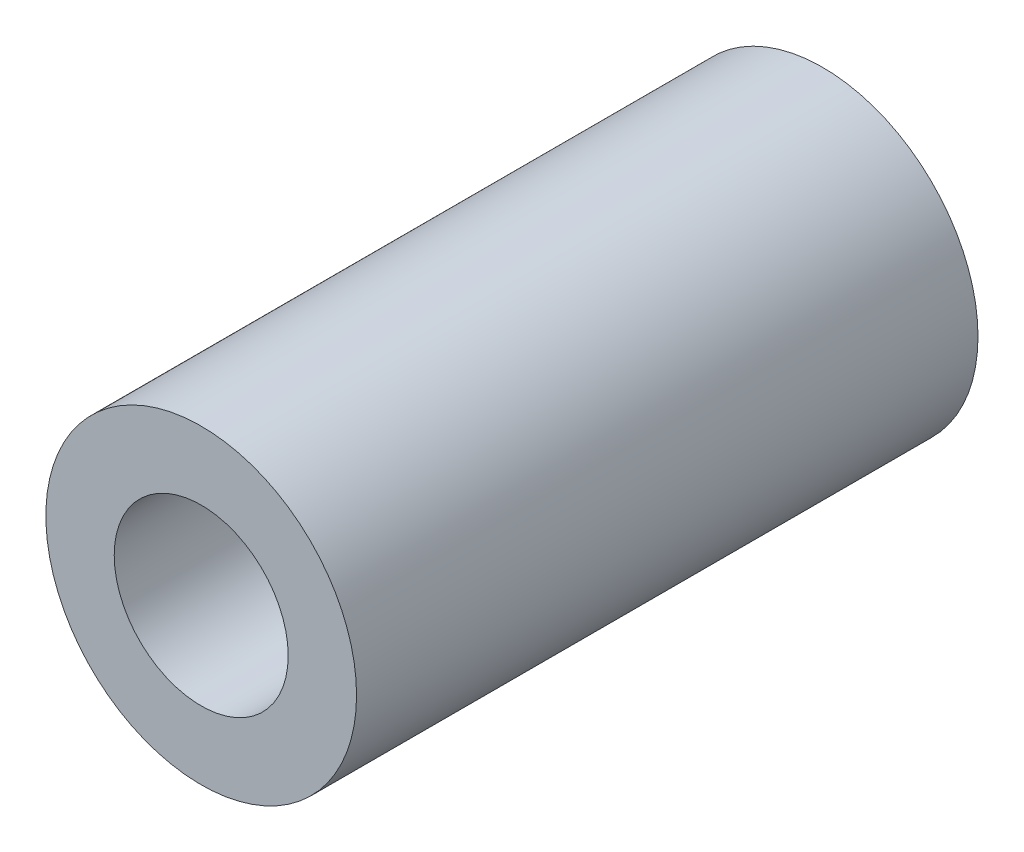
ISO-10303-21;
HEADER;
FILE_DESCRIPTION(('STEP AP214'),'2;1');
FILE_NAME('part.step','',(''),(''),'','','');
FILE_SCHEMA(('AUTOMOTIVE_DESIGN { 1 0 10303 214 1 1 1 1 }'));
ENDSEC;
DATA;
#1=APPLICATION_CONTEXT('core data for automotive mechanical design processes');
#2=APPLICATION_PROTOCOL_DEFINITION('international standard','automotive_design',2000,#1);
#3=PRODUCT_CONTEXT('',#1,'mechanical');
#4=PRODUCT('Part','Part','',(#3));
#5=PRODUCT_RELATED_PRODUCT_CATEGORY('part','',(#4));
#6=PRODUCT_DEFINITION_FORMATION('','',#4);
#7=PRODUCT_DEFINITION_CONTEXT('part definition',#1,'design');
#8=PRODUCT_DEFINITION('design','',#6,#7);
#9=PRODUCT_DEFINITION_SHAPE('','',#8);
#10=(LENGTH_UNIT() NAMED_UNIT(*) SI_UNIT(.MILLI.,.METRE.));
#11=(NAMED_UNIT(*) PLANE_ANGLE_UNIT() SI_UNIT($,.RADIAN.));
#12=(NAMED_UNIT(*) SI_UNIT($,.STERADIAN.) SOLID_ANGLE_UNIT());
#13=UNCERTAINTY_MEASURE_WITH_UNIT(LENGTH_MEASURE(1.E-05),#10,'distance_accuracy_value','');
#14=(GEOMETRIC_REPRESENTATION_CONTEXT(3) GLOBAL_UNCERTAINTY_ASSIGNED_CONTEXT((#13)) GLOBAL_UNIT_ASSIGNED_CONTEXT((#10,
#11,#12)) REPRESENTATION_CONTEXT('',''));
#15=CARTESIAN_POINT('',(0.,0.,0.));
#16=DIRECTION('',(0.,0.,1.));
#17=DIRECTION('',(1.,0.,0.));
#18=AXIS2_PLACEMENT_3D('',#15,#16,#17);
#19=CARTESIAN_POINT('',(7.,0.,7.));
#20=DIRECTION('',(0.,0.,-1.));
#21=DIRECTION('',(-1.,0.,0.));
#22=AXIS2_PLACEMENT_3D('',#19,#20,#21);
#23=PLANE('',#22);
#24=CARTESIAN_POINT('',(0.,0.,7.));
#25=DIRECTION('',(0.,0.,1.));
#26=DIRECTION('',(1.,0.,0.));
#27=AXIS2_PLACEMENT_3D('',#24,#25,#26);
#28=CIRCLE('',#27,4.5);
#29=CARTESIAN_POINT('',(4.5,0.,7.));
#30=VERTEX_POINT('',#29);
#31=EDGE_CURVE('E8',#30,#30,#28,.T.);
#32=ORIENTED_EDGE('',*,*,#31,.F.);
#33=EDGE_LOOP('',(#32));
#34=FACE_BOUND('',#33,.T.);
#35=CARTESIAN_POINT('',(0.,0.,7.));
#36=DIRECTION('',(0.,0.,1.));
#37=DIRECTION('',(1.,0.,0.));
#38=AXIS2_PLACEMENT_3D('',#35,#36,#37);
#39=CIRCLE('',#38,7.);
#40=CARTESIAN_POINT('',(7.,0.,7.));
#41=VERTEX_POINT('',#40);
#42=EDGE_CURVE('E34',#41,#41,#39,.T.);
#43=ORIENTED_EDGE('',*,*,#42,.T.);
#44=EDGE_LOOP('',(#43));
#45=FACE_BOUND('',#44,.T.);
#46=ADVANCED_FACE('F12',(#34,#45),#23,.F.);
#47=CARTESIAN_POINT('',(0.,0.,40.));
#48=DIRECTION('',(0.,0.,1.));
#49=DIRECTION('',(1.,0.,0.));
#50=AXIS2_PLACEMENT_3D('',#47,#48,#49);
#51=CYLINDRICAL_SURFACE('',#50,4.5);
#52=CARTESIAN_POINT('',(0.,0.,0.));
#53=DIRECTION('',(0.,0.,1.));
#54=DIRECTION('',(1.,0.,0.));
#55=AXIS2_PLACEMENT_3D('',#52,#53,#54);
#56=CIRCLE('',#55,4.5);
#57=CARTESIAN_POINT('',(4.5,0.,0.));
#58=VERTEX_POINT('',#57);
#59=EDGE_CURVE('E18',#58,#58,#56,.T.);
#60=ORIENTED_EDGE('',*,*,#59,.F.);
#61=EDGE_LOOP('',(#60));
#62=FACE_BOUND('',#61,.T.);
#63=ORIENTED_EDGE('',*,*,#31,.T.);
#64=EDGE_LOOP('',(#63));
#65=FACE_BOUND('',#64,.T.);
#66=ADVANCED_FACE('F59',(#62,#65),#51,.F.);
#67=CARTESIAN_POINT('',(4.5,0.,0.));
#68=DIRECTION('',(0.,0.,1.));
#69=DIRECTION('',(1.,0.,0.));
#70=AXIS2_PLACEMENT_3D('',#67,#68,#69);
#71=PLANE('',#70);
#72=CARTESIAN_POINT('',(0.,0.,0.));
#73=DIRECTION('',(0.,0.,1.));
#74=DIRECTION('',(1.,0.,0.));
#75=AXIS2_PLACEMENT_3D('',#72,#73,#74);
#76=CIRCLE('',#75,12.5);
#77=CARTESIAN_POINT('',(12.5,0.,0.));
#78=VERTEX_POINT('',#77);
#79=EDGE_CURVE('E22',#78,#78,#76,.T.);
#80=ORIENTED_EDGE('',*,*,#79,.F.);
#81=EDGE_LOOP('',(#80));
#82=FACE_BOUND('',#81,.T.);
#83=ORIENTED_EDGE('',*,*,#59,.T.);
#84=EDGE_LOOP('',(#83));
#85=FACE_BOUND('',#84,.T.);
#86=ADVANCED_FACE('F54',(#82,#85),#71,.F.);
#87=CARTESIAN_POINT('',(0.,0.,40.));
#88=DIRECTION('',(0.,0.,1.));
#89=DIRECTION('',(1.,0.,0.));
#90=AXIS2_PLACEMENT_3D('',#87,#88,#89);
#91=CYLINDRICAL_SURFACE('',#90,12.5);
#92=CARTESIAN_POINT('',(0.,0.,50.));
#93=DIRECTION('',(0.,0.,1.));
#94=DIRECTION('',(1.,0.,0.));
#95=AXIS2_PLACEMENT_3D('',#92,#93,#94);
#96=CIRCLE('',#95,12.5);
#97=CARTESIAN_POINT('',(12.5,0.,50.));
#98=VERTEX_POINT('',#97);
#99=EDGE_CURVE('E26',#98,#98,#96,.T.);
#100=ORIENTED_EDGE('',*,*,#99,.F.);
#101=EDGE_LOOP('',(#100));
#102=FACE_BOUND('',#101,.T.);
#103=ORIENTED_EDGE('',*,*,#79,.T.);
#104=EDGE_LOOP('',(#103));
#105=FACE_BOUND('',#104,.T.);
#106=ADVANCED_FACE('F48',(#102,#105),#91,.T.);
#107=CARTESIAN_POINT('',(12.5,0.,50.));
#108=DIRECTION('',(0.,0.,-1.));
#109=DIRECTION('',(-1.,0.,0.));
#110=AXIS2_PLACEMENT_3D('',#107,#108,#109);
#111=PLANE('',#110);
#112=CARTESIAN_POINT('',(0.,0.,50.));
#113=DIRECTION('',(0.,0.,1.));
#114=DIRECTION('',(1.,0.,0.));
#115=AXIS2_PLACEMENT_3D('',#112,#113,#114);
#116=CIRCLE('',#115,7.);
#117=CARTESIAN_POINT('',(7.,0.,50.));
#118=VERTEX_POINT('',#117);
#119=EDGE_CURVE('E31',#118,#118,#116,.T.);
#120=ORIENTED_EDGE('',*,*,#119,.F.);
#121=EDGE_LOOP('',(#120));
#122=FACE_BOUND('',#121,.T.);
#123=ORIENTED_EDGE('',*,*,#99,.T.);
#124=EDGE_LOOP('',(#123));
#125=FACE_BOUND('',#124,.T.);
#126=ADVANCED_FACE('F42',(#122,#125),#111,.F.);
#127=CARTESIAN_POINT('',(0.,0.,40.));
#128=DIRECTION('',(0.,0.,1.));
#129=DIRECTION('',(1.,0.,0.));
#130=AXIS2_PLACEMENT_3D('',#127,#128,#129);
#131=CYLINDRICAL_SURFACE('',#130,7.);
#132=ORIENTED_EDGE('',*,*,#42,.F.);
#133=EDGE_LOOP('',(#132));
#134=FACE_BOUND('',#133,.T.);
#135=ORIENTED_EDGE('',*,*,#119,.T.);
#136=EDGE_LOOP('',(#135));
#137=FACE_BOUND('',#136,.T.);
#138=ADVANCED_FACE('F39',(#134,#137),#131,.F.);
#139=CLOSED_SHELL('',(#46,#66,#86,#106,#126,#138));
#140=MANIFOLD_SOLID_BREP('B1',#139);
#141=ADVANCED_BREP_SHAPE_REPRESENTATION('',(#18,#140),#14);
#142=SHAPE_DEFINITION_REPRESENTATION(#9,#141);
ENDSEC;
END-ISO-10303-21;
